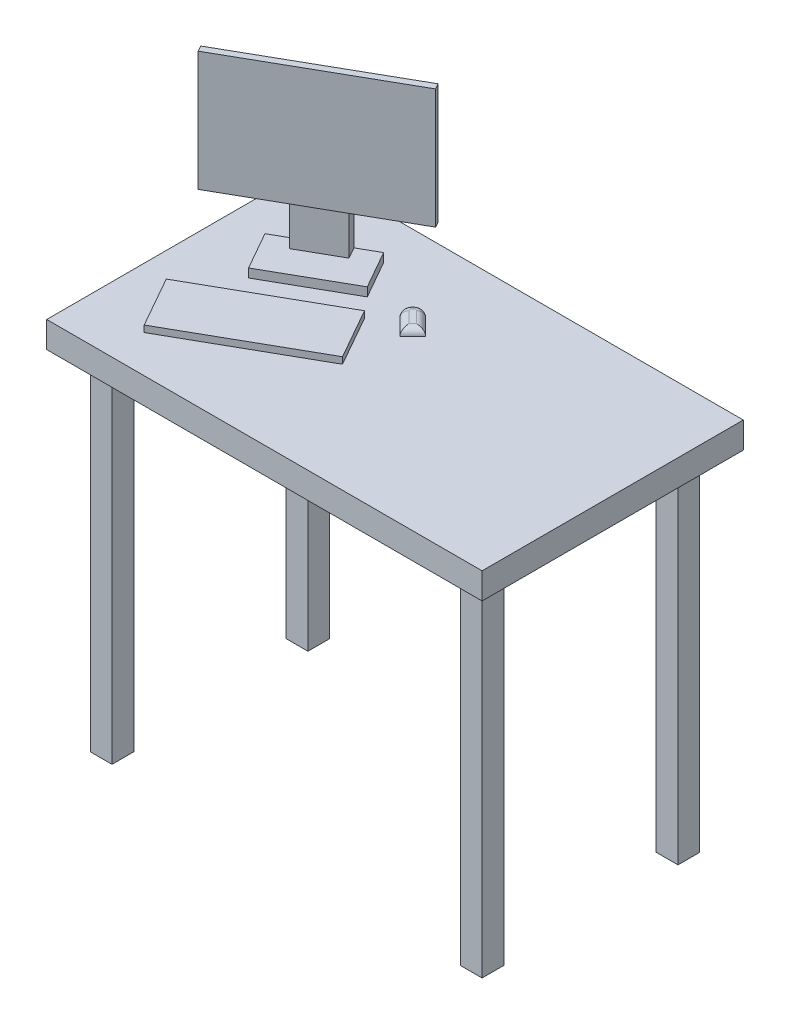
ISO-10303-21;
HEADER;
FILE_DESCRIPTION(('STEP AP214'),'2;1');
FILE_NAME('part.step','',(''),(''),'','','');
FILE_SCHEMA(('AUTOMOTIVE_DESIGN { 1 0 10303 214 1 1 1 1 }'));
ENDSEC;
DATA;
#1=APPLICATION_CONTEXT('core data for automotive mechanical design processes');
#2=APPLICATION_PROTOCOL_DEFINITION('international standard','automotive_design',2000,#1);
#3=PRODUCT_CONTEXT('',#1,'mechanical');
#4=PRODUCT('Part','Part','',(#3));
#5=PRODUCT_RELATED_PRODUCT_CATEGORY('part','',(#4));
#6=PRODUCT_DEFINITION_FORMATION('','',#4);
#7=PRODUCT_DEFINITION_CONTEXT('part definition',#1,'design');
#8=PRODUCT_DEFINITION('design','',#6,#7);
#9=PRODUCT_DEFINITION_SHAPE('','',#8);
#10=(LENGTH_UNIT() NAMED_UNIT(*) SI_UNIT(.MILLI.,.METRE.));
#11=(NAMED_UNIT(*) PLANE_ANGLE_UNIT() SI_UNIT($,.RADIAN.));
#12=(NAMED_UNIT(*) SI_UNIT($,.STERADIAN.) SOLID_ANGLE_UNIT());
#13=UNCERTAINTY_MEASURE_WITH_UNIT(LENGTH_MEASURE(1.E-05),#10,'distance_accuracy_value','');
#14=(GEOMETRIC_REPRESENTATION_CONTEXT(3) GLOBAL_UNCERTAINTY_ASSIGNED_CONTEXT((#13)) GLOBAL_UNIT_ASSIGNED_CONTEXT((#10,
#11,#12)) REPRESENTATION_CONTEXT('',''));
#15=CARTESIAN_POINT('',(0.,0.,0.));
#16=DIRECTION('',(0.,0.,1.));
#17=DIRECTION('',(1.,0.,0.));
#18=AXIS2_PLACEMENT_3D('',#15,#16,#17);
#19=CARTESIAN_POINT('',(0.,60.,0.));
#20=DIRECTION('',(0.,1.,0.));
#21=DIRECTION('',(0.,0.,1.));
#22=AXIS2_PLACEMENT_3D('',#19,#20,#21);
#23=PLANE('',#22);
#24=DIRECTION('',(0.,0.,1.));
#25=VECTOR('',#24,1.);
#26=CARTESIAN_POINT('',(-500.,60.,300.));
#27=LINE('',#26,#25);
#28=CARTESIAN_POINT('',(-500.,60.,-300.));
#29=VERTEX_POINT('',#28);
#30=CARTESIAN_POINT('',(-500.,60.,300.));
#31=VERTEX_POINT('',#30);
#32=EDGE_CURVE('E1023',#29,#31,#27,.T.);
#33=ORIENTED_EDGE('',*,*,#32,.T.);
#34=DIRECTION('',(1.,0.,0.));
#35=VECTOR('',#34,1.);
#36=CARTESIAN_POINT('',(500.,60.,300.));
#37=LINE('',#36,#35);
#38=CARTESIAN_POINT('',(500.,60.,300.));
#39=VERTEX_POINT('',#38);
#40=EDGE_CURVE('E1025',#31,#39,#37,.T.);
#41=ORIENTED_EDGE('',*,*,#40,.T.);
#42=DIRECTION('',(0.,0.,-1.));
#43=VECTOR('',#42,1.);
#44=CARTESIAN_POINT('',(500.,60.,300.));
#45=LINE('',#44,#43);
#46=CARTESIAN_POINT('',(500.,60.,-300.));
#47=VERTEX_POINT('',#46);
#48=EDGE_CURVE('E1028',#39,#47,#45,.T.);
#49=ORIENTED_EDGE('',*,*,#48,.T.);
#50=DIRECTION('',(-1.,0.,0.));
#51=VECTOR('',#50,1.);
#52=CARTESIAN_POINT('',(500.,60.,-300.));
#53=LINE('',#52,#51);
#54=EDGE_CURVE('E1030',#47,#29,#53,.T.);
#55=ORIENTED_EDGE('',*,*,#54,.T.);
#56=EDGE_LOOP('',(#33,#41,#49,#55));
#57=FACE_BOUND('',#56,.T.);
#58=DIRECTION('',(-0.493721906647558,0.,-0.869619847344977));
#59=VECTOR('',#58,1.);
#60=CARTESIAN_POINT('',(-176.703839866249,60.,-113.038015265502));
#61=LINE('',#60,#59);
#62=CARTESIAN_POINT('',(-176.703839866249,60.,-113.038015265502));
#63=VERTEX_POINT('',#62);
#64=CARTESIAN_POINT('',(-226.076030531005,60.,-200.));
#65=VERTEX_POINT('',#64);
#66=EDGE_CURVE('E1067',#63,#65,#61,.T.);
#67=ORIENTED_EDGE('',*,*,#66,.F.);
#68=DIRECTION('',(0.869619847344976,0.,-0.493721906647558));
#69=VECTOR('',#68,1.);
#70=CARTESIAN_POINT('',(-350.627809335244,60.,-14.293633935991));
#71=LINE('',#70,#69);
#72=CARTESIAN_POINT('',(-350.627809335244,60.,-14.293633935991));
#73=VERTEX_POINT('',#72);
#74=EDGE_CURVE('E1064',#73,#63,#71,.T.);
#75=ORIENTED_EDGE('',*,*,#74,.F.);
#76=DIRECTION('',(0.493721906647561,0.,0.869619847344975));
#77=VECTOR('',#76,1.);
#78=CARTESIAN_POINT('',(-350.627809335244,60.,-14.293633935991));
#79=LINE('',#78,#77);
#80=CARTESIAN_POINT('',(-400.,60.,-101.255618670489));
#81=VERTEX_POINT('',#80);
#82=EDGE_CURVE('E1073',#81,#73,#79,.T.);
#83=ORIENTED_EDGE('',*,*,#82,.F.);
#84=DIRECTION('',(-0.869619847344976,0.,0.493721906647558));
#85=VECTOR('',#84,1.);
#86=CARTESIAN_POINT('',(-400.,60.,-101.255618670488));
#87=LINE('',#86,#85);
#88=EDGE_CURVE('E1070',#65,#81,#87,.T.);
#89=ORIENTED_EDGE('',*,*,#88,.F.);
#90=EDGE_LOOP('',(#67,#75,#83,#89));
#91=FACE_BOUND('',#90,.T.);
#92=DIRECTION('',(0.87017204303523,0.,-0.492748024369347));
#93=VECTOR('',#92,1.);
#94=CARTESIAN_POINT('',(-361.990492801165,60.,214.095381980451));
#95=LINE('',#94,#93);
#96=CARTESIAN_POINT('',(-361.990492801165,60.,214.095381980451));
#97=VERTEX_POINT('',#96);
#98=CARTESIAN_POINT('',(-71.1847467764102,60.,49.422248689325));
#99=VERTEX_POINT('',#98);
#100=EDGE_CURVE('E351',#97,#99,#95,.T.);
#101=ORIENTED_EDGE('',*,*,#100,.F.);
#102=DIRECTION('',(0.492748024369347,0.,0.870172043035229));
#103=VECTOR('',#102,1.);
#104=CARTESIAN_POINT('',(-428.123184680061,60.,97.3078622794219));
#105=LINE('',#104,#103);
#106=CARTESIAN_POINT('',(-428.123184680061,60.,97.3078622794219));
#107=VERTEX_POINT('',#106);
#108=EDGE_CURVE('E337',#107,#97,#105,.T.);
#109=ORIENTED_EDGE('',*,*,#108,.F.);
#110=DIRECTION('',(-0.870172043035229,0.,0.492748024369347));
#111=VECTOR('',#110,1.);
#112=CARTESIAN_POINT('',(-428.123184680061,60.,97.3078622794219));
#113=LINE('',#112,#111);
#114=CARTESIAN_POINT('',(-137.317438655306,60.,-67.3652710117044));
#115=VERTEX_POINT('',#114);
#116=EDGE_CURVE('E342',#115,#107,#113,.T.);
#117=ORIENTED_EDGE('',*,*,#116,.F.);
#118=DIRECTION('',(-0.492748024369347,0.,-0.870172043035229));
#119=VECTOR('',#118,1.);
#120=CARTESIAN_POINT('',(-137.317438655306,60.,-67.3652710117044));
#121=LINE('',#120,#119);
#122=EDGE_CURVE('E353',#99,#115,#121,.T.);
#123=ORIENTED_EDGE('',*,*,#122,.F.);
#124=EDGE_LOOP('',(#101,#109,#117,#123));
#125=FACE_BOUND('',#124,.T.);
#126=DIRECTION('',(0.707106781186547,0.,-0.707106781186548));
#127=VECTOR('',#126,1.);
#128=CARTESIAN_POINT('',(-60.5107468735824,60.,-71.5720058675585));
#129=LINE('',#128,#127);
#130=CARTESIAN_POINT('',(-60.5107468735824,60.,-71.5720058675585));
#131=VERTEX_POINT('',#130);
#132=CARTESIAN_POINT('',(-30.7579985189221,60.,-101.324754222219));
#133=VERTEX_POINT('',#132);
#134=EDGE_CURVE('E316',#131,#133,#129,.T.);
#135=ORIENTED_EDGE('',*,*,#134,.F.);
#136=DIRECTION('',(0.707106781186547,0.,0.707106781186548));
#137=VECTOR('',#136,1.);
#138=CARTESIAN_POINT('',(-111.152332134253,60.,-122.213591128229));
#139=LINE('',#138,#137);
#140=CARTESIAN_POINT('',(-97.0101965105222,60.,-108.071455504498));
#141=VERTEX_POINT('',#140);
#142=EDGE_CURVE('E323',#141,#131,#139,.T.);
#143=ORIENTED_EDGE('',*,*,#142,.F.);
#144=CARTESIAN_POINT('',(-82.8680608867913,60.,-122.213591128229));
#145=DIRECTION('',(0.,1.,0.));
#146=DIRECTION('',(0.,0.,1.));
#147=AXIS2_PLACEMENT_3D('',#144,#145,#146);
#148=CIRCLE('',#147,20.);
#149=CARTESIAN_POINT('',(-97.0101965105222,60.,-136.35572675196));
#150=VERTEX_POINT('',#149);
#151=EDGE_CURVE('E433',#141,#150,#148,.F.);
#152=ORIENTED_EDGE('',*,*,#151,.T.);
#153=DIRECTION('',(-0.707106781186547,0.,0.707106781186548));
#154=VECTOR('',#153,1.);
#155=CARTESIAN_POINT('',(-111.152332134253,60.,-122.213591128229));
#156=LINE('',#155,#154);
#157=CARTESIAN_POINT('',(-95.5417194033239,60.,-137.824203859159));
#158=VERTEX_POINT('',#157);
#159=EDGE_CURVE('E332',#158,#150,#156,.T.);
#160=ORIENTED_EDGE('',*,*,#159,.F.);
#161=CARTESIAN_POINT('',(-81.399583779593,60.,-123.682068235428));
#162=DIRECTION('',(0.,1.,0.));
#163=DIRECTION('',(0.,0.,1.));
#164=AXIS2_PLACEMENT_3D('',#161,#162,#163);
#165=CIRCLE('',#164,20.);
#166=CARTESIAN_POINT('',(-67.257448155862,60.,-137.824203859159));
#167=VERTEX_POINT('',#166);
#168=EDGE_CURVE('E431',#158,#167,#165,.F.);
#169=ORIENTED_EDGE('',*,*,#168,.T.);
#170=DIRECTION('',(-0.707106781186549,0.,-0.707106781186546));
#171=VECTOR('',#170,1.);
#172=CARTESIAN_POINT('',(-81.399583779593,60.,-151.96633948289));
#173=LINE('',#172,#171);
#174=EDGE_CURVE('E330',#133,#167,#173,.T.);
#175=ORIENTED_EDGE('',*,*,#174,.F.);
#176=EDGE_LOOP('',(#135,#143,#152,#160,#169,#175));
#177=FACE_BOUND('',#176,.T.);
#178=ADVANCED_FACE('F37',(#57,#91,#125,#177),#23,.T.);
#179=CARTESIAN_POINT('',(-341.707350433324,280.,-99.8531185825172));
#180=DIRECTION('',(-0.493721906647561,0.,-0.869619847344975));
#181=DIRECTION('',(-0.869619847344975,0.,0.493721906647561));
#182=AXIS2_PLACEMENT_3D('',#179,#180,#181);
#183=PLANE('',#182);
#184=DIRECTION('',(0.869619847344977,0.,-0.493721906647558));
#185=VECTOR('',#184,1.);
#186=CARTESIAN_POINT('',(-472.150327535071,180.,-25.7948325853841));
#187=LINE('',#186,#185);
#188=CARTESIAN_POINT('',(-341.707350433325,180.,-99.8531185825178));
#189=VERTEX_POINT('',#188);
#190=CARTESIAN_POINT('',(-254.745365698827,180.,-149.225309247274));
#191=VERTEX_POINT('',#190);
#192=EDGE_CURVE('E385',#189,#191,#187,.T.);
#193=ORIENTED_EDGE('',*,*,#192,.F.);
#194=DIRECTION('',(0.,-1.,0.));
#195=VECTOR('',#194,1.);
#196=CARTESIAN_POINT('',(-341.707350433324,280.,-99.8531185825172));
#197=LINE('',#196,#195);
#198=CARTESIAN_POINT('',(-341.707350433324,80.,-99.8531185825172));
#199=VERTEX_POINT('',#198);
#200=EDGE_CURVE('E1245',#189,#199,#197,.T.);
#201=ORIENTED_EDGE('',*,*,#200,.T.);
#202=DIRECTION('',(0.869619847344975,0.,-0.493721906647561));
#203=VECTOR('',#202,1.);
#204=CARTESIAN_POINT('',(-341.707350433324,80.,-99.8531185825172));
#205=LINE('',#204,#203);
#206=CARTESIAN_POINT('',(-254.745365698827,80.,-149.225309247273));
#207=VERTEX_POINT('',#206);
#208=EDGE_CURVE('E412',#199,#207,#205,.T.);
#209=ORIENTED_EDGE('',*,*,#208,.T.);
#210=DIRECTION('',(0.,-1.,0.));
#211=VECTOR('',#210,1.);
#212=CARTESIAN_POINT('',(-254.745365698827,280.,-149.225309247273));
#213=LINE('',#212,#211);
#214=EDGE_CURVE('E428',#191,#207,#213,.T.);
#215=ORIENTED_EDGE('',*,*,#214,.F.);
#216=EDGE_LOOP('',(#193,#201,#209,#215));
#217=FACE_BOUND('',#216,.T.);
#218=ADVANCED_FACE('F476',(#217),#183,.F.);
#219=CARTESIAN_POINT('',(0.,0.,0.));
#220=DIRECTION('',(0.,1.,0.));
#221=DIRECTION('',(0.,0.,1.));
#222=AXIS2_PLACEMENT_3D('',#219,#220,#221);
#223=PLANE('',#222);
#224=DIRECTION('',(1.,0.,0.));
#225=VECTOR('',#224,1.);
#226=CARTESIAN_POINT('',(-450.,0.,-200.));
#227=LINE('',#226,#225);
#228=CARTESIAN_POINT('',(-450.,0.,-200.));
#229=VERTEX_POINT('',#228);
#230=CARTESIAN_POINT('',(-400.,0.,-200.));
#231=VERTEX_POINT('',#230);
#232=EDGE_CURVE('E1102',#229,#231,#227,.T.);
#233=ORIENTED_EDGE('',*,*,#232,.T.);
#234=DIRECTION('',(0.,0.,-1.));
#235=VECTOR('',#234,1.);
#236=CARTESIAN_POINT('',(-400.,0.,-250.));
#237=LINE('',#236,#235);
#238=CARTESIAN_POINT('',(-400.,0.,-250.));
#239=VERTEX_POINT('',#238);
#240=EDGE_CURVE('E1085',#231,#239,#237,.T.);
#241=ORIENTED_EDGE('',*,*,#240,.T.);
#242=DIRECTION('',(-1.,0.,0.));
#243=VECTOR('',#242,1.);
#244=CARTESIAN_POINT('',(-450.,0.,-250.));
#245=LINE('',#244,#243);
#246=CARTESIAN_POINT('',(-450.,0.,-250.));
#247=VERTEX_POINT('',#246);
#248=EDGE_CURVE('E1090',#239,#247,#245,.T.);
#249=ORIENTED_EDGE('',*,*,#248,.T.);
#250=DIRECTION('',(0.,0.,1.));
#251=VECTOR('',#250,1.);
#252=CARTESIAN_POINT('',(-450.,0.,-250.));
#253=LINE('',#252,#251);
#254=EDGE_CURVE('E1105',#247,#229,#253,.T.);
#255=ORIENTED_EDGE('',*,*,#254,.T.);
#256=EDGE_LOOP('',(#233,#241,#249,#255));
#257=FACE_BOUND('',#256,.T.);
#258=DIRECTION('',(0.,0.,1.));
#259=VECTOR('',#258,1.);
#260=CARTESIAN_POINT('',(-400.,0.,250.));
#261=LINE('',#260,#259);
#262=CARTESIAN_POINT('',(-400.,0.,200.));
#263=VERTEX_POINT('',#262);
#264=CARTESIAN_POINT('',(-400.,0.,250.));
#265=VERTEX_POINT('',#264);
#266=EDGE_CURVE('E989',#263,#265,#261,.T.);
#267=ORIENTED_EDGE('',*,*,#266,.F.);
#268=DIRECTION('',(1.,0.,0.));
#269=VECTOR('',#268,1.);
#270=CARTESIAN_POINT('',(-450.,0.,200.));
#271=LINE('',#270,#269);
#272=CARTESIAN_POINT('',(-450.,0.,200.));
#273=VERTEX_POINT('',#272);
#274=EDGE_CURVE('E1011',#273,#263,#271,.T.);
#275=ORIENTED_EDGE('',*,*,#274,.F.);
#276=DIRECTION('',(0.,0.,-1.));
#277=VECTOR('',#276,1.);
#278=CARTESIAN_POINT('',(-450.,0.,250.));
#279=LINE('',#278,#277);
#280=CARTESIAN_POINT('',(-450.,0.,250.));
#281=VERTEX_POINT('',#280);
#282=EDGE_CURVE('E1001',#281,#273,#279,.T.);
#283=ORIENTED_EDGE('',*,*,#282,.F.);
#284=DIRECTION('',(-1.,0.,0.));
#285=VECTOR('',#284,1.);
#286=CARTESIAN_POINT('',(-450.,0.,250.));
#287=LINE('',#286,#285);
#288=EDGE_CURVE('E997',#265,#281,#287,.T.);
#289=ORIENTED_EDGE('',*,*,#288,.F.);
#290=EDGE_LOOP('',(#267,#275,#283,#289));
#291=FACE_BOUND('',#290,.T.);
#292=DIRECTION('',(0.,0.,1.));
#293=VECTOR('',#292,1.);
#294=CARTESIAN_POINT('',(-500.,0.,300.));
#295=LINE('',#294,#293);
#296=CARTESIAN_POINT('',(-500.,0.,-300.));
#297=VERTEX_POINT('',#296);
#298=CARTESIAN_POINT('',(-500.,0.,300.));
#299=VERTEX_POINT('',#298);
#300=EDGE_CURVE('E1022',#297,#299,#295,.T.);
#301=ORIENTED_EDGE('',*,*,#300,.F.);
#302=DIRECTION('',(-1.,0.,0.));
#303=VECTOR('',#302,1.);
#304=CARTESIAN_POINT('',(500.,0.,-300.));
#305=LINE('',#304,#303);
#306=CARTESIAN_POINT('',(500.,0.,-300.));
#307=VERTEX_POINT('',#306);
#308=EDGE_CURVE('E1026',#307,#297,#305,.T.);
#309=ORIENTED_EDGE('',*,*,#308,.F.);
#310=DIRECTION('',(0.,0.,-1.));
#311=VECTOR('',#310,1.);
#312=CARTESIAN_POINT('',(500.,0.,300.));
#313=LINE('',#312,#311);
#314=CARTESIAN_POINT('',(500.,0.,300.));
#315=VERTEX_POINT('',#314);
#316=EDGE_CURVE('E1037',#315,#307,#313,.T.);
#317=ORIENTED_EDGE('',*,*,#316,.F.);
#318=DIRECTION('',(1.,0.,0.));
#319=VECTOR('',#318,1.);
#320=CARTESIAN_POINT('',(500.,0.,300.));
#321=LINE('',#320,#319);
#322=EDGE_CURVE('E1035',#299,#315,#321,.T.);
#323=ORIENTED_EDGE('',*,*,#322,.F.);
#324=EDGE_LOOP('',(#301,#309,#317,#323));
#325=FACE_BOUND('',#324,.T.);
#326=DIRECTION('',(-1.,0.,0.));
#327=VECTOR('',#326,1.);
#328=CARTESIAN_POINT('',(450.,0.,200.));
#329=LINE('',#328,#327);
#330=CARTESIAN_POINT('',(450.,0.,200.));
#331=VERTEX_POINT('',#330);
#332=CARTESIAN_POINT('',(400.,0.,200.));
#333=VERTEX_POINT('',#332);
#334=EDGE_CURVE('E1168',#331,#333,#329,.T.);
#335=ORIENTED_EDGE('',*,*,#334,.T.);
#336=DIRECTION('',(0.,0.,1.));
#337=VECTOR('',#336,1.);
#338=CARTESIAN_POINT('',(400.,0.,250.));
#339=LINE('',#338,#337);
#340=CARTESIAN_POINT('',(400.,0.,250.));
#341=VERTEX_POINT('',#340);
#342=EDGE_CURVE('E1151',#333,#341,#339,.T.);
#343=ORIENTED_EDGE('',*,*,#342,.T.);
#344=DIRECTION('',(1.,0.,0.));
#345=VECTOR('',#344,1.);
#346=CARTESIAN_POINT('',(450.,0.,250.));
#347=LINE('',#346,#345);
#348=CARTESIAN_POINT('',(450.,0.,250.));
#349=VERTEX_POINT('',#348);
#350=EDGE_CURVE('E1156',#341,#349,#347,.T.);
#351=ORIENTED_EDGE('',*,*,#350,.T.);
#352=DIRECTION('',(0.,0.,-1.));
#353=VECTOR('',#352,1.);
#354=CARTESIAN_POINT('',(450.,0.,250.));
#355=LINE('',#354,#353);
#356=EDGE_CURVE('E1171',#349,#331,#355,.T.);
#357=ORIENTED_EDGE('',*,*,#356,.T.);
#358=EDGE_LOOP('',(#335,#343,#351,#357));
#359=FACE_BOUND('',#358,.T.);
#360=DIRECTION('',(0.,0.,-1.));
#361=VECTOR('',#360,1.);
#362=CARTESIAN_POINT('',(400.,0.,-250.));
#363=LINE('',#362,#361);
#364=CARTESIAN_POINT('',(400.,0.,-200.));
#365=VERTEX_POINT('',#364);
#366=CARTESIAN_POINT('',(400.,0.,-250.));
#367=VERTEX_POINT('',#366);
#368=EDGE_CURVE('E1118',#365,#367,#363,.T.);
#369=ORIENTED_EDGE('',*,*,#368,.F.);
#370=DIRECTION('',(-1.,0.,0.));
#371=VECTOR('',#370,1.);
#372=CARTESIAN_POINT('',(450.,0.,-200.));
#373=LINE('',#372,#371);
#374=CARTESIAN_POINT('',(450.,0.,-200.));
#375=VERTEX_POINT('',#374);
#376=EDGE_CURVE('E1123',#375,#365,#373,.T.);
#377=ORIENTED_EDGE('',*,*,#376,.F.);
#378=DIRECTION('',(0.,0.,1.));
#379=VECTOR('',#378,1.);
#380=CARTESIAN_POINT('',(450.,0.,-250.));
#381=LINE('',#380,#379);
#382=CARTESIAN_POINT('',(450.,0.,-250.));
#383=VERTEX_POINT('',#382);
#384=EDGE_CURVE('E1135',#383,#375,#381,.T.);
#385=ORIENTED_EDGE('',*,*,#384,.F.);
#386=DIRECTION('',(1.,0.,0.));
#387=VECTOR('',#386,1.);
#388=CARTESIAN_POINT('',(450.,0.,-250.));
#389=LINE('',#388,#387);
#390=EDGE_CURVE('E1132',#367,#383,#389,.T.);
#391=ORIENTED_EDGE('',*,*,#390,.F.);
#392=EDGE_LOOP('',(#369,#377,#385,#391));
#393=FACE_BOUND('',#392,.T.);
#394=ADVANCED_FACE('F482',(#257,#291,#325,#359,#393),#223,.F.);
#395=CARTESIAN_POINT('',(-500.,60.,300.));
#396=DIRECTION('',(1.,0.,0.));
#397=DIRECTION('',(0.,0.,-1.));
#398=AXIS2_PLACEMENT_3D('',#395,#396,#397);
#399=PLANE('',#398);
#400=ORIENTED_EDGE('',*,*,#300,.T.);
#401=DIRECTION('',(0.,-1.,0.));
#402=VECTOR('',#401,1.);
#403=CARTESIAN_POINT('',(-500.,60.,300.));
#404=LINE('',#403,#402);
#405=EDGE_CURVE('E434',#31,#299,#404,.T.);
#406=ORIENTED_EDGE('',*,*,#405,.F.);
#407=ORIENTED_EDGE('',*,*,#32,.F.);
#408=DIRECTION('',(0.,-1.,0.));
#409=VECTOR('',#408,1.);
#410=CARTESIAN_POINT('',(-500.,60.,-300.));
#411=LINE('',#410,#409);
#412=EDGE_CURVE('E1032',#29,#297,#411,.T.);
#413=ORIENTED_EDGE('',*,*,#412,.T.);
#414=EDGE_LOOP('',(#400,#406,#407,#413));
#415=FACE_BOUND('',#414,.T.);
#416=ADVANCED_FACE('F493',(#415),#399,.F.);
#417=CARTESIAN_POINT('',(500.,60.,300.));
#418=DIRECTION('',(0.,0.,-1.));
#419=DIRECTION('',(-1.,0.,0.));
#420=AXIS2_PLACEMENT_3D('',#417,#418,#419);
#421=PLANE('',#420);
#422=ORIENTED_EDGE('',*,*,#322,.T.);
#423=DIRECTION('',(0.,-1.,0.));
#424=VECTOR('',#423,1.);
#425=CARTESIAN_POINT('',(500.,60.,300.));
#426=LINE('',#425,#424);
#427=EDGE_CURVE('E1045',#39,#315,#426,.T.);
#428=ORIENTED_EDGE('',*,*,#427,.F.);
#429=ORIENTED_EDGE('',*,*,#40,.F.);
#430=ORIENTED_EDGE('',*,*,#405,.T.);
#431=EDGE_LOOP('',(#422,#428,#429,#430));
#432=FACE_BOUND('',#431,.T.);
#433=ADVANCED_FACE('F502',(#432),#421,.F.);
#434=CARTESIAN_POINT('',(500.,60.,300.));
#435=DIRECTION('',(-1.,0.,0.));
#436=DIRECTION('',(0.,0.,1.));
#437=AXIS2_PLACEMENT_3D('',#434,#435,#436);
#438=PLANE('',#437);
#439=ORIENTED_EDGE('',*,*,#316,.T.);
#440=DIRECTION('',(0.,-1.,0.));
#441=VECTOR('',#440,1.);
#442=CARTESIAN_POINT('',(500.,60.,-300.));
#443=LINE('',#442,#441);
#444=EDGE_CURVE('E1042',#47,#307,#443,.T.);
#445=ORIENTED_EDGE('',*,*,#444,.F.);
#446=ORIENTED_EDGE('',*,*,#48,.F.);
#447=ORIENTED_EDGE('',*,*,#427,.T.);
#448=EDGE_LOOP('',(#439,#445,#446,#447));
#449=FACE_BOUND('',#448,.T.);
#450=ADVANCED_FACE('F498',(#449),#438,.F.);
#451=CARTESIAN_POINT('',(500.,60.,-300.));
#452=DIRECTION('',(0.,0.,1.));
#453=DIRECTION('',(1.,0.,0.));
#454=AXIS2_PLACEMENT_3D('',#451,#452,#453);
#455=PLANE('',#454);
#456=ORIENTED_EDGE('',*,*,#308,.T.);
#457=ORIENTED_EDGE('',*,*,#412,.F.);
#458=ORIENTED_EDGE('',*,*,#54,.F.);
#459=ORIENTED_EDGE('',*,*,#444,.T.);
#460=EDGE_LOOP('',(#456,#457,#458,#459));
#461=FACE_BOUND('',#460,.T.);
#462=ADVANCED_FACE('F495',(#461),#455,.F.);
#463=CARTESIAN_POINT('',(-400.,-800.,250.));
#464=DIRECTION('',(-1.,0.,0.));
#465=DIRECTION('',(0.,0.,1.));
#466=AXIS2_PLACEMENT_3D('',#463,#464,#465);
#467=PLANE('',#466);
#468=ORIENTED_EDGE('',*,*,#266,.T.);
#469=DIRECTION('',(0.,1.,0.));
#470=VECTOR('',#469,1.);
#471=CARTESIAN_POINT('',(-400.,-800.,250.));
#472=LINE('',#471,#470);
#473=CARTESIAN_POINT('',(-400.,-800.,250.));
#474=VERTEX_POINT('',#473);
#475=EDGE_CURVE('E992',#474,#265,#472,.T.);
#476=ORIENTED_EDGE('',*,*,#475,.F.);
#477=DIRECTION('',(0.,0.,1.));
#478=VECTOR('',#477,1.);
#479=CARTESIAN_POINT('',(-400.,-800.,250.));
#480=LINE('',#479,#478);
#481=CARTESIAN_POINT('',(-400.,-800.,200.));
#482=VERTEX_POINT('',#481);
#483=EDGE_CURVE('E1013',#482,#474,#480,.T.);
#484=ORIENTED_EDGE('',*,*,#483,.F.);
#485=DIRECTION('',(0.,1.,0.));
#486=VECTOR('',#485,1.);
#487=CARTESIAN_POINT('',(-400.,-800.,200.));
#488=LINE('',#487,#486);
#489=EDGE_CURVE('E994',#482,#263,#488,.T.);
#490=ORIENTED_EDGE('',*,*,#489,.T.);
#491=EDGE_LOOP('',(#468,#476,#484,#490));
#492=FACE_BOUND('',#491,.T.);
#493=ADVANCED_FACE('F489',(#492),#467,.F.);
#494=CARTESIAN_POINT('',(-450.,-800.,250.));
#495=DIRECTION('',(0.,0.,-1.));
#496=DIRECTION('',(-1.,0.,0.));
#497=AXIS2_PLACEMENT_3D('',#494,#495,#496);
#498=PLANE('',#497);
#499=ORIENTED_EDGE('',*,*,#288,.T.);
#500=DIRECTION('',(0.,1.,0.));
#501=VECTOR('',#500,1.);
#502=CARTESIAN_POINT('',(-450.,-800.,250.));
#503=LINE('',#502,#501);
#504=CARTESIAN_POINT('',(-450.,-800.,250.));
#505=VERTEX_POINT('',#504);
#506=EDGE_CURVE('E1018',#505,#281,#503,.T.);
#507=ORIENTED_EDGE('',*,*,#506,.F.);
#508=DIRECTION('',(-1.,0.,0.));
#509=VECTOR('',#508,1.);
#510=CARTESIAN_POINT('',(-450.,-800.,250.));
#511=LINE('',#510,#509);
#512=EDGE_CURVE('E1183',#474,#505,#511,.T.);
#513=ORIENTED_EDGE('',*,*,#512,.F.);
#514=ORIENTED_EDGE('',*,*,#475,.T.);
#515=EDGE_LOOP('',(#499,#507,#513,#514));
#516=FACE_BOUND('',#515,.T.);
#517=ADVANCED_FACE('F941',(#516),#498,.F.);
#518=CARTESIAN_POINT('',(-450.,-800.,250.));
#519=DIRECTION('',(1.,0.,0.));
#520=DIRECTION('',(0.,0.,-1.));
#521=AXIS2_PLACEMENT_3D('',#518,#519,#520);
#522=PLANE('',#521);
#523=ORIENTED_EDGE('',*,*,#282,.T.);
#524=DIRECTION('',(0.,1.,0.));
#525=VECTOR('',#524,1.);
#526=CARTESIAN_POINT('',(-450.,-800.,200.));
#527=LINE('',#526,#525);
#528=CARTESIAN_POINT('',(-450.,-800.,200.));
#529=VERTEX_POINT('',#528);
#530=EDGE_CURVE('E1015',#529,#273,#527,.T.);
#531=ORIENTED_EDGE('',*,*,#530,.F.);
#532=DIRECTION('',(0.,0.,-1.));
#533=VECTOR('',#532,1.);
#534=CARTESIAN_POINT('',(-450.,-800.,250.));
#535=LINE('',#534,#533);
#536=EDGE_CURVE('E1184',#505,#529,#535,.T.);
#537=ORIENTED_EDGE('',*,*,#536,.F.);
#538=ORIENTED_EDGE('',*,*,#506,.T.);
#539=EDGE_LOOP('',(#523,#531,#537,#538));
#540=FACE_BOUND('',#539,.T.);
#541=ADVANCED_FACE('F931',(#540),#522,.F.);
#542=CARTESIAN_POINT('',(-450.,-800.,200.));
#543=DIRECTION('',(0.,0.,1.));
#544=DIRECTION('',(1.,0.,0.));
#545=AXIS2_PLACEMENT_3D('',#542,#543,#544);
#546=PLANE('',#545);
#547=ORIENTED_EDGE('',*,*,#274,.T.);
#548=ORIENTED_EDGE('',*,*,#489,.F.);
#549=DIRECTION('',(1.,0.,0.));
#550=VECTOR('',#549,1.);
#551=CARTESIAN_POINT('',(-450.,-800.,200.));
#552=LINE('',#551,#550);
#553=EDGE_CURVE('E1006',#529,#482,#552,.T.);
#554=ORIENTED_EDGE('',*,*,#553,.F.);
#555=ORIENTED_EDGE('',*,*,#530,.T.);
#556=EDGE_LOOP('',(#547,#548,#554,#555));
#557=FACE_BOUND('',#556,.T.);
#558=ADVANCED_FACE('F921',(#557),#546,.F.);
#559=CARTESIAN_POINT('',(0.,-800.,0.));
#560=DIRECTION('',(0.,-1.,0.));
#561=DIRECTION('',(0.,0.,-1.));
#562=AXIS2_PLACEMENT_3D('',#559,#560,#561);
#563=PLANE('',#562);
#564=ORIENTED_EDGE('',*,*,#483,.T.);
#565=ORIENTED_EDGE('',*,*,#512,.T.);
#566=ORIENTED_EDGE('',*,*,#536,.T.);
#567=ORIENTED_EDGE('',*,*,#553,.T.);
#568=EDGE_LOOP('',(#564,#565,#566,#567));
#569=FACE_BOUND('',#568,.T.);
#570=ADVANCED_FACE('F911',(#569),#563,.T.);
#571=CARTESIAN_POINT('',(400.,-800.,250.));
#572=DIRECTION('',(-1.,0.,0.));
#573=DIRECTION('',(0.,0.,1.));
#574=AXIS2_PLACEMENT_3D('',#571,#572,#573);
#575=PLANE('',#574);
#576=ORIENTED_EDGE('',*,*,#342,.F.);
#577=DIRECTION('',(0.,1.,0.));
#578=VECTOR('',#577,1.);
#579=CARTESIAN_POINT('',(400.,-800.,200.));
#580=LINE('',#579,#578);
#581=CARTESIAN_POINT('',(400.,-800.,200.));
#582=VERTEX_POINT('',#581);
#583=EDGE_CURVE('E998',#582,#333,#580,.T.);
#584=ORIENTED_EDGE('',*,*,#583,.F.);
#585=DIRECTION('',(0.,0.,1.));
#586=VECTOR('',#585,1.);
#587=CARTESIAN_POINT('',(400.,-800.,250.));
#588=LINE('',#587,#586);
#589=CARTESIAN_POINT('',(400.,-800.,250.));
#590=VERTEX_POINT('',#589);
#591=EDGE_CURVE('E1152',#582,#590,#588,.T.);
#592=ORIENTED_EDGE('',*,*,#591,.T.);
#593=DIRECTION('',(0.,1.,0.));
#594=VECTOR('',#593,1.);
#595=CARTESIAN_POINT('',(400.,-800.,250.));
#596=LINE('',#595,#594);
#597=EDGE_CURVE('E1165',#590,#341,#596,.T.);
#598=ORIENTED_EDGE('',*,*,#597,.T.);
#599=EDGE_LOOP('',(#576,#584,#592,#598));
#600=FACE_BOUND('',#599,.T.);
#601=ADVANCED_FACE('F901',(#600),#575,.T.);
#602=CARTESIAN_POINT('',(450.,-800.,200.));
#603=DIRECTION('',(0.,0.,-1.));
#604=DIRECTION('',(-1.,0.,0.));
#605=AXIS2_PLACEMENT_3D('',#602,#603,#604);
#606=PLANE('',#605);
#607=ORIENTED_EDGE('',*,*,#334,.F.);
#608=DIRECTION('',(0.,1.,0.));
#609=VECTOR('',#608,1.);
#610=CARTESIAN_POINT('',(450.,-800.,200.));
#611=LINE('',#610,#609);
#612=CARTESIAN_POINT('',(450.,-800.,200.));
#613=VERTEX_POINT('',#612);
#614=EDGE_CURVE('E1003',#613,#331,#611,.T.);
#615=ORIENTED_EDGE('',*,*,#614,.F.);
#616=DIRECTION('',(-1.,0.,0.));
#617=VECTOR('',#616,1.);
#618=CARTESIAN_POINT('',(450.,-800.,200.));
#619=LINE('',#618,#617);
#620=EDGE_CURVE('E1155',#613,#582,#619,.T.);
#621=ORIENTED_EDGE('',*,*,#620,.T.);
#622=ORIENTED_EDGE('',*,*,#583,.T.);
#623=EDGE_LOOP('',(#607,#615,#621,#622));
#624=FACE_BOUND('',#623,.T.);
#625=ADVANCED_FACE('F891',(#624),#606,.T.);
#626=CARTESIAN_POINT('',(450.,-800.,250.));
#627=DIRECTION('',(1.,0.,0.));
#628=DIRECTION('',(0.,0.,-1.));
#629=AXIS2_PLACEMENT_3D('',#626,#627,#628);
#630=PLANE('',#629);
#631=ORIENTED_EDGE('',*,*,#356,.F.);
#632=DIRECTION('',(0.,1.,0.));
#633=VECTOR('',#632,1.);
#634=CARTESIAN_POINT('',(450.,-800.,250.));
#635=LINE('',#634,#633);
#636=CARTESIAN_POINT('',(450.,-800.,250.));
#637=VERTEX_POINT('',#636);
#638=EDGE_CURVE('E1177',#637,#349,#635,.T.);
#639=ORIENTED_EDGE('',*,*,#638,.F.);
#640=DIRECTION('',(0.,0.,-1.));
#641=VECTOR('',#640,1.);
#642=CARTESIAN_POINT('',(450.,-800.,250.));
#643=LINE('',#642,#641);
#644=EDGE_CURVE('E1159',#637,#613,#643,.T.);
#645=ORIENTED_EDGE('',*,*,#644,.T.);
#646=ORIENTED_EDGE('',*,*,#614,.T.);
#647=EDGE_LOOP('',(#631,#639,#645,#646));
#648=FACE_BOUND('',#647,.T.);
#649=ADVANCED_FACE('F879',(#648),#630,.T.);
#650=CARTESIAN_POINT('',(450.,-800.,250.));
#651=DIRECTION('',(0.,0.,1.));
#652=DIRECTION('',(1.,0.,0.));
#653=AXIS2_PLACEMENT_3D('',#650,#651,#652);
#654=PLANE('',#653);
#655=ORIENTED_EDGE('',*,*,#350,.F.);
#656=ORIENTED_EDGE('',*,*,#597,.F.);
#657=DIRECTION('',(1.,0.,0.));
#658=VECTOR('',#657,1.);
#659=CARTESIAN_POINT('',(450.,-800.,250.));
#660=LINE('',#659,#658);
#661=EDGE_CURVE('E1162',#590,#637,#660,.T.);
#662=ORIENTED_EDGE('',*,*,#661,.T.);
#663=ORIENTED_EDGE('',*,*,#638,.T.);
#664=EDGE_LOOP('',(#655,#656,#662,#663));
#665=FACE_BOUND('',#664,.T.);
#666=ADVANCED_FACE('F867',(#665),#654,.T.);
#667=CARTESIAN_POINT('',(0.,-800.,0.));
#668=DIRECTION('',(0.,-1.,0.));
#669=DIRECTION('',(0.,0.,-1.));
#670=AXIS2_PLACEMENT_3D('',#667,#668,#669);
#671=PLANE('',#670);
#672=ORIENTED_EDGE('',*,*,#591,.F.);
#673=ORIENTED_EDGE('',*,*,#620,.F.);
#674=ORIENTED_EDGE('',*,*,#644,.F.);
#675=ORIENTED_EDGE('',*,*,#661,.F.);
#676=EDGE_LOOP('',(#672,#673,#674,#675));
#677=FACE_BOUND('',#676,.T.);
#678=ADVANCED_FACE('F851',(#677),#671,.T.);
#679=CARTESIAN_POINT('',(400.,-800.,-250.));
#680=DIRECTION('',(1.,0.,0.));
#681=DIRECTION('',(0.,0.,-1.));
#682=AXIS2_PLACEMENT_3D('',#679,#680,#681);
#683=PLANE('',#682);
#684=ORIENTED_EDGE('',*,*,#368,.T.);
#685=DIRECTION('',(0.,1.,0.));
#686=VECTOR('',#685,1.);
#687=CARTESIAN_POINT('',(400.,-800.,-250.));
#688=LINE('',#687,#686);
#689=CARTESIAN_POINT('',(400.,-800.,-250.));
#690=VERTEX_POINT('',#689);
#691=EDGE_CURVE('E1148',#690,#367,#688,.T.);
#692=ORIENTED_EDGE('',*,*,#691,.F.);
#693=DIRECTION('',(0.,0.,-1.));
#694=VECTOR('',#693,1.);
#695=CARTESIAN_POINT('',(400.,-800.,-250.));
#696=LINE('',#695,#694);
#697=CARTESIAN_POINT('',(400.,-800.,-200.));
#698=VERTEX_POINT('',#697);
#699=EDGE_CURVE('E1119',#698,#690,#696,.T.);
#700=ORIENTED_EDGE('',*,*,#699,.F.);
#701=DIRECTION('',(0.,1.,0.));
#702=VECTOR('',#701,1.);
#703=CARTESIAN_POINT('',(400.,-800.,-200.));
#704=LINE('',#703,#702);
#705=EDGE_CURVE('E1129',#698,#365,#704,.T.);
#706=ORIENTED_EDGE('',*,*,#705,.T.);
#707=EDGE_LOOP('',(#684,#692,#700,#706));
#708=FACE_BOUND('',#707,.T.);
#709=ADVANCED_FACE('F841',(#708),#683,.F.);
#710=CARTESIAN_POINT('',(450.,-800.,-250.));
#711=DIRECTION('',(0.,0.,1.));
#712=DIRECTION('',(1.,0.,0.));
#713=AXIS2_PLACEMENT_3D('',#710,#711,#712);
#714=PLANE('',#713);
#715=ORIENTED_EDGE('',*,*,#390,.T.);
#716=DIRECTION('',(0.,1.,0.));
#717=VECTOR('',#716,1.);
#718=CARTESIAN_POINT('',(450.,-800.,-250.));
#719=LINE('',#718,#717);
#720=CARTESIAN_POINT('',(450.,-800.,-250.));
#721=VERTEX_POINT('',#720);
#722=EDGE_CURVE('E1145',#721,#383,#719,.T.);
#723=ORIENTED_EDGE('',*,*,#722,.F.);
#724=DIRECTION('',(1.,0.,0.));
#725=VECTOR('',#724,1.);
#726=CARTESIAN_POINT('',(450.,-800.,-250.));
#727=LINE('',#726,#725);
#728=EDGE_CURVE('E1122',#690,#721,#727,.T.);
#729=ORIENTED_EDGE('',*,*,#728,.F.);
#730=ORIENTED_EDGE('',*,*,#691,.T.);
#731=EDGE_LOOP('',(#715,#723,#729,#730));
#732=FACE_BOUND('',#731,.T.);
#733=ADVANCED_FACE('F831',(#732),#714,.F.);
#734=CARTESIAN_POINT('',(450.,-800.,-250.));
#735=DIRECTION('',(-1.,0.,0.));
#736=DIRECTION('',(0.,0.,1.));
#737=AXIS2_PLACEMENT_3D('',#734,#735,#736);
#738=PLANE('',#737);
#739=ORIENTED_EDGE('',*,*,#384,.T.);
#740=DIRECTION('',(0.,1.,0.));
#741=VECTOR('',#740,1.);
#742=CARTESIAN_POINT('',(450.,-800.,-200.));
#743=LINE('',#742,#741);
#744=CARTESIAN_POINT('',(450.,-800.,-200.));
#745=VERTEX_POINT('',#744);
#746=EDGE_CURVE('E1142',#745,#375,#743,.T.);
#747=ORIENTED_EDGE('',*,*,#746,.F.);
#748=DIRECTION('',(0.,0.,1.));
#749=VECTOR('',#748,1.);
#750=CARTESIAN_POINT('',(450.,-800.,-250.));
#751=LINE('',#750,#749);
#752=EDGE_CURVE('E1125',#721,#745,#751,.T.);
#753=ORIENTED_EDGE('',*,*,#752,.F.);
#754=ORIENTED_EDGE('',*,*,#722,.T.);
#755=EDGE_LOOP('',(#739,#747,#753,#754));
#756=FACE_BOUND('',#755,.T.);
#757=ADVANCED_FACE('F820',(#756),#738,.F.);
#758=CARTESIAN_POINT('',(450.,-800.,-200.));
#759=DIRECTION('',(0.,0.,-1.));
#760=DIRECTION('',(-1.,0.,0.));
#761=AXIS2_PLACEMENT_3D('',#758,#759,#760);
#762=PLANE('',#761);
#763=ORIENTED_EDGE('',*,*,#376,.T.);
#764=ORIENTED_EDGE('',*,*,#705,.F.);
#765=DIRECTION('',(-1.,0.,0.));
#766=VECTOR('',#765,1.);
#767=CARTESIAN_POINT('',(450.,-800.,-200.));
#768=LINE('',#767,#766);
#769=EDGE_CURVE('E1127',#745,#698,#768,.T.);
#770=ORIENTED_EDGE('',*,*,#769,.F.);
#771=ORIENTED_EDGE('',*,*,#746,.T.);
#772=EDGE_LOOP('',(#763,#764,#770,#771));
#773=FACE_BOUND('',#772,.T.);
#774=ADVANCED_FACE('F808',(#773),#762,.F.);
#775=CARTESIAN_POINT('',(0.,-800.,0.));
#776=DIRECTION('',(0.,-1.,0.));
#777=DIRECTION('',(0.,0.,1.));
#778=AXIS2_PLACEMENT_3D('',#775,#776,#777);
#779=PLANE('',#778);
#780=ORIENTED_EDGE('',*,*,#699,.T.);
#781=ORIENTED_EDGE('',*,*,#728,.T.);
#782=ORIENTED_EDGE('',*,*,#752,.T.);
#783=ORIENTED_EDGE('',*,*,#769,.T.);
#784=EDGE_LOOP('',(#780,#781,#782,#783));
#785=FACE_BOUND('',#784,.T.);
#786=ADVANCED_FACE('F796',(#785),#779,.T.);
#787=CARTESIAN_POINT('',(-400.,-800.,-250.));
#788=DIRECTION('',(1.,0.,0.));
#789=DIRECTION('',(0.,0.,-1.));
#790=AXIS2_PLACEMENT_3D('',#787,#788,#789);
#791=PLANE('',#790);
#792=ORIENTED_EDGE('',*,*,#240,.F.);
#793=DIRECTION('',(0.,1.,0.));
#794=VECTOR('',#793,1.);
#795=CARTESIAN_POINT('',(-400.,-800.,-200.));
#796=LINE('',#795,#794);
#797=CARTESIAN_POINT('',(-400.,-800.,-200.));
#798=VERTEX_POINT('',#797);
#799=EDGE_CURVE('E1116',#798,#231,#796,.T.);
#800=ORIENTED_EDGE('',*,*,#799,.F.);
#801=DIRECTION('',(0.,0.,-1.));
#802=VECTOR('',#801,1.);
#803=CARTESIAN_POINT('',(-400.,-800.,-250.));
#804=LINE('',#803,#802);
#805=CARTESIAN_POINT('',(-400.,-800.,-250.));
#806=VERTEX_POINT('',#805);
#807=EDGE_CURVE('E1086',#798,#806,#804,.T.);
#808=ORIENTED_EDGE('',*,*,#807,.T.);
#809=DIRECTION('',(0.,1.,0.));
#810=VECTOR('',#809,1.);
#811=CARTESIAN_POINT('',(-400.,-800.,-250.));
#812=LINE('',#811,#810);
#813=EDGE_CURVE('E1099',#806,#239,#812,.T.);
#814=ORIENTED_EDGE('',*,*,#813,.T.);
#815=EDGE_LOOP('',(#792,#800,#808,#814));
#816=FACE_BOUND('',#815,.T.);
#817=ADVANCED_FACE('F786',(#816),#791,.T.);
#818=CARTESIAN_POINT('',(-450.,-800.,-200.));
#819=DIRECTION('',(0.,0.,1.));
#820=DIRECTION('',(1.,0.,0.));
#821=AXIS2_PLACEMENT_3D('',#818,#819,#820);
#822=PLANE('',#821);
#823=ORIENTED_EDGE('',*,*,#232,.F.);
#824=DIRECTION('',(0.,1.,0.));
#825=VECTOR('',#824,1.);
#826=CARTESIAN_POINT('',(-450.,-800.,-200.));
#827=LINE('',#826,#825);
#828=CARTESIAN_POINT('',(-450.,-800.,-200.));
#829=VERTEX_POINT('',#828);
#830=EDGE_CURVE('E1114',#829,#229,#827,.T.);
#831=ORIENTED_EDGE('',*,*,#830,.F.);
#832=DIRECTION('',(1.,0.,0.));
#833=VECTOR('',#832,1.);
#834=CARTESIAN_POINT('',(-450.,-800.,-200.));
#835=LINE('',#834,#833);
#836=EDGE_CURVE('E1089',#829,#798,#835,.T.);
#837=ORIENTED_EDGE('',*,*,#836,.T.);
#838=ORIENTED_EDGE('',*,*,#799,.T.);
#839=EDGE_LOOP('',(#823,#831,#837,#838));
#840=FACE_BOUND('',#839,.T.);
#841=ADVANCED_FACE('F776',(#840),#822,.T.);
#842=CARTESIAN_POINT('',(-450.,-800.,-250.));
#843=DIRECTION('',(-1.,0.,0.));
#844=DIRECTION('',(0.,0.,1.));
#845=AXIS2_PLACEMENT_3D('',#842,#843,#844);
#846=PLANE('',#845);
#847=ORIENTED_EDGE('',*,*,#254,.F.);
#848=DIRECTION('',(0.,1.,0.));
#849=VECTOR('',#848,1.);
#850=CARTESIAN_POINT('',(-450.,-800.,-250.));
#851=LINE('',#850,#849);
#852=CARTESIAN_POINT('',(-450.,-800.,-250.));
#853=VERTEX_POINT('',#852);
#854=EDGE_CURVE('E1111',#853,#247,#851,.T.);
#855=ORIENTED_EDGE('',*,*,#854,.F.);
#856=DIRECTION('',(0.,0.,1.));
#857=VECTOR('',#856,1.);
#858=CARTESIAN_POINT('',(-450.,-800.,-250.));
#859=LINE('',#858,#857);
#860=EDGE_CURVE('E1093',#853,#829,#859,.T.);
#861=ORIENTED_EDGE('',*,*,#860,.T.);
#862=ORIENTED_EDGE('',*,*,#830,.T.);
#863=EDGE_LOOP('',(#847,#855,#861,#862));
#864=FACE_BOUND('',#863,.T.);
#865=ADVANCED_FACE('F764',(#864),#846,.T.);
#866=CARTESIAN_POINT('',(-450.,-800.,-250.));
#867=DIRECTION('',(0.,0.,-1.));
#868=DIRECTION('',(-1.,0.,0.));
#869=AXIS2_PLACEMENT_3D('',#866,#867,#868);
#870=PLANE('',#869);
#871=ORIENTED_EDGE('',*,*,#248,.F.);
#872=ORIENTED_EDGE('',*,*,#813,.F.);
#873=DIRECTION('',(-1.,0.,0.));
#874=VECTOR('',#873,1.);
#875=CARTESIAN_POINT('',(-450.,-800.,-250.));
#876=LINE('',#875,#874);
#877=EDGE_CURVE('E1096',#806,#853,#876,.T.);
#878=ORIENTED_EDGE('',*,*,#877,.T.);
#879=ORIENTED_EDGE('',*,*,#854,.T.);
#880=EDGE_LOOP('',(#871,#872,#878,#879));
#881=FACE_BOUND('',#880,.T.);
#882=ADVANCED_FACE('F751',(#881),#870,.T.);
#883=CARTESIAN_POINT('',(0.,-800.,0.));
#884=DIRECTION('',(0.,-1.,0.));
#885=DIRECTION('',(0.,0.,1.));
#886=AXIS2_PLACEMENT_3D('',#883,#884,#885);
#887=PLANE('',#886);
#888=ORIENTED_EDGE('',*,*,#807,.F.);
#889=ORIENTED_EDGE('',*,*,#836,.F.);
#890=ORIENTED_EDGE('',*,*,#860,.F.);
#891=ORIENTED_EDGE('',*,*,#877,.F.);
#892=EDGE_LOOP('',(#888,#889,#890,#891));
#893=FACE_BOUND('',#892,.T.);
#894=ADVANCED_FACE('F740',(#893),#887,.T.);
#895=CARTESIAN_POINT('',(-350.627809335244,80.,-14.293633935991));
#896=DIRECTION('',(-0.493721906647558,0.,-0.869619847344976));
#897=DIRECTION('',(-0.869619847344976,0.,0.493721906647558));
#898=AXIS2_PLACEMENT_3D('',#895,#896,#897);
#899=PLANE('',#898);
#900=ORIENTED_EDGE('',*,*,#74,.T.);
#901=DIRECTION('',(0.,-1.,0.));
#902=VECTOR('',#901,1.);
#903=CARTESIAN_POINT('',(-176.703839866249,80.,-113.038015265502));
#904=LINE('',#903,#902);
#905=CARTESIAN_POINT('',(-176.703839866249,80.,-113.038015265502));
#906=VERTEX_POINT('',#905);
#907=EDGE_CURVE('E1083',#906,#63,#904,.T.);
#908=ORIENTED_EDGE('',*,*,#907,.F.);
#909=DIRECTION('',(0.869619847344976,0.,-0.493721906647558));
#910=VECTOR('',#909,1.);
#911=CARTESIAN_POINT('',(-350.627809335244,80.,-14.293633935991));
#912=LINE('',#911,#910);
#913=CARTESIAN_POINT('',(-350.627809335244,80.,-14.293633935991));
#914=VERTEX_POINT('',#913);
#915=EDGE_CURVE('E1075',#914,#906,#912,.T.);
#916=ORIENTED_EDGE('',*,*,#915,.F.);
#917=DIRECTION('',(0.,-1.,0.));
#918=VECTOR('',#917,1.);
#919=CARTESIAN_POINT('',(-350.627809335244,80.,-14.293633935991));
#920=LINE('',#919,#918);
#921=EDGE_CURVE('E1063',#914,#73,#920,.T.);
#922=ORIENTED_EDGE('',*,*,#921,.T.);
#923=EDGE_LOOP('',(#900,#908,#916,#922));
#924=FACE_BOUND('',#923,.T.);
#925=ADVANCED_FACE('F730',(#924),#899,.F.);
#926=CARTESIAN_POINT('',(-176.703839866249,80.,-113.038015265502));
#927=DIRECTION('',(-0.869619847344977,0.,0.493721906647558));
#928=DIRECTION('',(0.493721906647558,0.,0.869619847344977));
#929=AXIS2_PLACEMENT_3D('',#926,#927,#928);
#930=PLANE('',#929);
#931=ORIENTED_EDGE('',*,*,#66,.T.);
#932=DIRECTION('',(0.,-1.,0.));
#933=VECTOR('',#932,1.);
#934=CARTESIAN_POINT('',(-226.076030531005,80.,-200.));
#935=LINE('',#934,#933);
#936=CARTESIAN_POINT('',(-226.076030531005,80.,-200.));
#937=VERTEX_POINT('',#936);
#938=EDGE_CURVE('E1080',#937,#65,#935,.T.);
#939=ORIENTED_EDGE('',*,*,#938,.F.);
#940=DIRECTION('',(-0.493721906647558,0.,-0.869619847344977));
#941=VECTOR('',#940,1.);
#942=CARTESIAN_POINT('',(-176.703839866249,80.,-113.038015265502));
#943=LINE('',#942,#941);
#944=EDGE_CURVE('E1059',#906,#937,#943,.T.);
#945=ORIENTED_EDGE('',*,*,#944,.F.);
#946=ORIENTED_EDGE('',*,*,#907,.T.);
#947=EDGE_LOOP('',(#931,#939,#945,#946));
#948=FACE_BOUND('',#947,.T.);
#949=ADVANCED_FACE('F704',(#948),#930,.F.);
#950=CARTESIAN_POINT('',(-400.,80.,-101.255618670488));
#951=DIRECTION('',(0.493721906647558,0.,0.869619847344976));
#952=DIRECTION('',(0.869619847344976,0.,-0.493721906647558));
#953=AXIS2_PLACEMENT_3D('',#950,#951,#952);
#954=PLANE('',#953);
#955=ORIENTED_EDGE('',*,*,#88,.T.);
#956=DIRECTION('',(0.,-1.,0.));
#957=VECTOR('',#956,1.);
#958=CARTESIAN_POINT('',(-400.,80.,-101.255618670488));
#959=LINE('',#958,#957);
#960=CARTESIAN_POINT('',(-400.,80.,-101.255618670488));
#961=VERTEX_POINT('',#960);
#962=EDGE_CURVE('E1078',#961,#81,#959,.T.);
#963=ORIENTED_EDGE('',*,*,#962,.F.);
#964=DIRECTION('',(-0.869619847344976,0.,0.493721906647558));
#965=VECTOR('',#964,1.);
#966=CARTESIAN_POINT('',(-400.,80.,-101.255618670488));
#967=LINE('',#966,#965);
#968=CARTESIAN_POINT('',(-356.519007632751,80.,-125.941714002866));
#969=VERTEX_POINT('',#968);
#970=EDGE_CURVE('E1054',#969,#961,#967,.T.);
#971=ORIENTED_EDGE('',*,*,#970,.F.);
#972=DIRECTION('',(0.,-1.,0.));
#973=VECTOR('',#972,1.);
#974=CARTESIAN_POINT('',(-356.519007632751,280.,-125.941714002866));
#975=LINE('',#974,#973);
#976=CARTESIAN_POINT('',(-356.519007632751,280.,-125.941714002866));
#977=VERTEX_POINT('',#976);
#978=EDGE_CURVE('E411',#977,#969,#975,.T.);
#979=ORIENTED_EDGE('',*,*,#978,.F.);
#980=DIRECTION('',(-0.869619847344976,0.,0.493721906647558));
#981=VECTOR('',#980,1.);
#982=CARTESIAN_POINT('',(-356.519007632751,280.,-125.941714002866));
#983=LINE('',#982,#981);
#984=CARTESIAN_POINT('',(-269.557022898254,280.,-175.313904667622));
#985=VERTEX_POINT('',#984);
#986=EDGE_CURVE('E409',#985,#977,#983,.T.);
#987=ORIENTED_EDGE('',*,*,#986,.F.);
#988=DIRECTION('',(0.,-1.,0.));
#989=VECTOR('',#988,1.);
#990=CARTESIAN_POINT('',(-269.557022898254,280.,-175.313904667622));
#991=LINE('',#990,#989);
#992=CARTESIAN_POINT('',(-269.557022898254,80.,-175.313904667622));
#993=VERTEX_POINT('',#992);
#994=EDGE_CURVE('E425',#985,#993,#991,.T.);
#995=ORIENTED_EDGE('',*,*,#994,.T.);
#996=EDGE_CURVE('E1050',#937,#993,#967,.T.);
#997=ORIENTED_EDGE('',*,*,#996,.F.);
#998=ORIENTED_EDGE('',*,*,#938,.T.);
#999=EDGE_LOOP('',(#955,#963,#971,#979,#987,#995,#997,#998));
#1000=FACE_BOUND('',#999,.T.);
#1001=ADVANCED_FACE('F696',(#1000),#954,.F.);
#1002=CARTESIAN_POINT('',(-350.627809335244,80.,-14.293633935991));
#1003=DIRECTION('',(0.869619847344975,0.,-0.493721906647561));
#1004=DIRECTION('',(-0.493721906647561,0.,-0.869619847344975));
#1005=AXIS2_PLACEMENT_3D('',#1002,#1003,#1004);
#1006=PLANE('',#1005);
#1007=ORIENTED_EDGE('',*,*,#82,.T.);
#1008=ORIENTED_EDGE('',*,*,#921,.F.);
#1009=DIRECTION('',(0.493721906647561,0.,0.869619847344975));
#1010=VECTOR('',#1009,1.);
#1011=CARTESIAN_POINT('',(-350.627809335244,80.,-14.293633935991));
#1012=LINE('',#1011,#1010);
#1013=EDGE_CURVE('E1053',#961,#914,#1012,.T.);
#1014=ORIENTED_EDGE('',*,*,#1013,.F.);
#1015=ORIENTED_EDGE('',*,*,#962,.T.);
#1016=EDGE_LOOP('',(#1007,#1008,#1014,#1015));
#1017=FACE_BOUND('',#1016,.T.);
#1018=ADVANCED_FACE('F703',(#1017),#1006,.F.);
#1019=CARTESIAN_POINT('',(0.,80.,0.));
#1020=DIRECTION('',(0.,1.,0.));
#1021=DIRECTION('',(0.,0.,1.));
#1022=AXIS2_PLACEMENT_3D('',#1019,#1020,#1021);
#1023=PLANE('',#1022);
#1024=DIRECTION('',(0.49372190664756,0.,0.869619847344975));
#1025=VECTOR('',#1024,1.);
#1026=CARTESIAN_POINT('',(-356.519007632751,80.,-125.941714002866));
#1027=LINE('',#1026,#1025);
#1028=EDGE_CURVE('E399',#969,#199,#1027,.T.);
#1029=ORIENTED_EDGE('',*,*,#1028,.F.);
#1030=ORIENTED_EDGE('',*,*,#970,.T.);
#1031=ORIENTED_EDGE('',*,*,#1013,.T.);
#1032=ORIENTED_EDGE('',*,*,#915,.T.);
#1033=ORIENTED_EDGE('',*,*,#944,.T.);
#1034=ORIENTED_EDGE('',*,*,#996,.T.);
#1035=DIRECTION('',(-0.493721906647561,0.,-0.869619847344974));
#1036=VECTOR('',#1035,1.);
#1037=CARTESIAN_POINT('',(-269.557022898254,80.,-175.313904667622));
#1038=LINE('',#1037,#1036);
#1039=EDGE_CURVE('E404',#207,#993,#1038,.T.);
#1040=ORIENTED_EDGE('',*,*,#1039,.F.);
#1041=ORIENTED_EDGE('',*,*,#208,.F.);
#1042=EDGE_LOOP('',(#1029,#1030,#1031,#1032,#1033,#1034,#1040,#1041));
#1043=FACE_BOUND('',#1042,.T.);
#1044=ADVANCED_FACE('F692',(#1043),#1023,.T.);
#1045=CARTESIAN_POINT('',(-356.519007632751,280.,-125.941714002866));
#1046=DIRECTION('',(0.869619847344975,0.,-0.49372190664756));
#1047=DIRECTION('',(-0.49372190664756,0.,-0.869619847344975));
#1048=AXIS2_PLACEMENT_3D('',#1045,#1046,#1047);
#1049=PLANE('',#1048);
#1050=ORIENTED_EDGE('',*,*,#1028,.T.);
#1051=ORIENTED_EDGE('',*,*,#200,.F.);
#1052=CARTESIAN_POINT('',(-341.707350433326,280.,-99.8531185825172));
#1053=VERTEX_POINT('',#1052);
#1054=EDGE_CURVE('E1068',#1053,#189,#197,.T.);
#1055=ORIENTED_EDGE('',*,*,#1054,.F.);
#1056=DIRECTION('',(0.49372190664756,0.,0.869619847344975));
#1057=VECTOR('',#1056,1.);
#1058=CARTESIAN_POINT('',(-356.519007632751,280.,-125.941714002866));
#1059=LINE('',#1058,#1057);
#1060=EDGE_CURVE('E400',#977,#1053,#1059,.T.);
#1061=ORIENTED_EDGE('',*,*,#1060,.F.);
#1062=ORIENTED_EDGE('',*,*,#978,.T.);
#1063=EDGE_LOOP('',(#1050,#1051,#1055,#1061,#1062));
#1064=FACE_BOUND('',#1063,.T.);
#1065=ADVANCED_FACE('F684',(#1064),#1049,.F.);
#1066=CARTESIAN_POINT('',(-269.557022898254,280.,-175.313904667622));
#1067=DIRECTION('',(-0.869619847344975,0.,0.493721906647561));
#1068=DIRECTION('',(0.493721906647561,0.,0.869619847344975));
#1069=AXIS2_PLACEMENT_3D('',#1066,#1067,#1068);
#1070=PLANE('',#1069);
#1071=ORIENTED_EDGE('',*,*,#1039,.T.);
#1072=ORIENTED_EDGE('',*,*,#994,.F.);
#1073=DIRECTION('',(-0.493721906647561,0.,-0.869619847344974));
#1074=VECTOR('',#1073,1.);
#1075=CARTESIAN_POINT('',(-269.557022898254,280.,-175.313904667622));
#1076=LINE('',#1075,#1074);
#1077=CARTESIAN_POINT('',(-254.745365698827,280.,-149.225309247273));
#1078=VERTEX_POINT('',#1077);
#1079=EDGE_CURVE('E407',#1078,#985,#1076,.T.);
#1080=ORIENTED_EDGE('',*,*,#1079,.F.);
#1081=EDGE_CURVE('E417',#1078,#191,#213,.T.);
#1082=ORIENTED_EDGE('',*,*,#1081,.T.);
#1083=ORIENTED_EDGE('',*,*,#214,.T.);
#1084=EDGE_LOOP('',(#1071,#1072,#1080,#1082,#1083));
#1085=FACE_BOUND('',#1084,.T.);
#1086=ADVANCED_FACE('F675',(#1085),#1070,.F.);
#1087=CARTESIAN_POINT('',(0.,280.,0.));
#1088=DIRECTION('',(0.,1.,0.));
#1089=DIRECTION('',(0.,0.,1.));
#1090=AXIS2_PLACEMENT_3D('',#1087,#1088,#1089);
#1091=PLANE('',#1090);
#1092=ORIENTED_EDGE('',*,*,#1060,.T.);
#1093=DIRECTION('',(0.869619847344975,0.,-0.493721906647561));
#1094=VECTOR('',#1093,1.);
#1095=CARTESIAN_POINT('',(-341.707350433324,280.,-99.8531185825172));
#1096=LINE('',#1095,#1094);
#1097=EDGE_CURVE('E403',#1053,#1078,#1096,.T.);
#1098=ORIENTED_EDGE('',*,*,#1097,.T.);
#1099=ORIENTED_EDGE('',*,*,#1079,.T.);
#1100=ORIENTED_EDGE('',*,*,#986,.T.);
#1101=EDGE_LOOP('',(#1092,#1098,#1099,#1100));
#1102=FACE_BOUND('',#1101,.T.);
#1103=ADVANCED_FACE('F659',(#1102),#1091,.T.);
#1104=CARTESIAN_POINT('',(-126.167008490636,0.,-222.224967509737));
#1105=DIRECTION('',(-0.493721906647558,0.,-0.869619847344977));
#1106=DIRECTION('',(-0.869619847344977,0.,0.493721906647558));
#1107=AXIS2_PLACEMENT_3D('',#1104,#1105,#1106);
#1108=PLANE('',#1107);
#1109=ORIENTED_EDGE('',*,*,#1054,.T.);
#1110=CARTESIAN_POINT('',(-472.150327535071,180.,-25.7948325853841));
#1111=VERTEX_POINT('',#1110);
#1112=EDGE_CURVE('E381',#1111,#189,#187,.T.);
#1113=ORIENTED_EDGE('',*,*,#1112,.F.);
#1114=DIRECTION('',(0.,-1.,0.));
#1115=VECTOR('',#1114,1.);
#1116=CARTESIAN_POINT('',(-472.150327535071,180.,-25.7948325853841));
#1117=LINE('',#1116,#1115);
#1118=CARTESIAN_POINT('',(-472.150327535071,455.,-25.7948325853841));
#1119=VERTEX_POINT('',#1118);
#1120=EDGE_CURVE('E366',#1119,#1111,#1117,.T.);
#1121=ORIENTED_EDGE('',*,*,#1120,.F.);
#1122=DIRECTION('',(-0.869619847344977,0.,0.493721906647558));
#1123=VECTOR('',#1122,1.);
#1124=CARTESIAN_POINT('',(-472.150327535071,455.,-25.7948325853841));
#1125=LINE('',#1124,#1123);
#1126=CARTESIAN_POINT('',(-124.302388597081,455.,-223.283595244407));
#1127=VERTEX_POINT('',#1126);
#1128=EDGE_CURVE('E371',#1127,#1119,#1125,.T.);
#1129=ORIENTED_EDGE('',*,*,#1128,.F.);
#1130=DIRECTION('',(0.,1.,0.));
#1131=VECTOR('',#1130,1.);
#1132=CARTESIAN_POINT('',(-124.302388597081,180.,-223.283595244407));
#1133=LINE('',#1132,#1131);
#1134=CARTESIAN_POINT('',(-124.302388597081,180.,-223.283595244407));
#1135=VERTEX_POINT('',#1134);
#1136=EDGE_CURVE('E384',#1135,#1127,#1133,.T.);
#1137=ORIENTED_EDGE('',*,*,#1136,.F.);
#1138=EDGE_CURVE('E380',#191,#1135,#187,.T.);
#1139=ORIENTED_EDGE('',*,*,#1138,.F.);
#1140=ORIENTED_EDGE('',*,*,#1081,.F.);
#1141=ORIENTED_EDGE('',*,*,#1097,.F.);
#1142=EDGE_LOOP('',(#1109,#1113,#1121,#1129,#1137,#1139,#1140,#1141));
#1143=FACE_BOUND('',#1142,.T.);
#1144=ADVANCED_FACE('F650',(#1143),#1108,.T.);
#1145=CARTESIAN_POINT('',(-464.744498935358,180.,-12.7505348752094));
#1146=DIRECTION('',(0.869619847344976,0.,-0.493721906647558));
#1147=DIRECTION('',(-0.493721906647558,0.,-0.869619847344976));
#1148=AXIS2_PLACEMENT_3D('',#1145,#1146,#1147);
#1149=PLANE('',#1148);
#1150=ORIENTED_EDGE('',*,*,#1120,.T.);
#1151=DIRECTION('',(-0.493721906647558,0.,-0.869619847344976));
#1152=VECTOR('',#1151,1.);
#1153=CARTESIAN_POINT('',(-464.744498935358,180.,-12.7505348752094));
#1154=LINE('',#1153,#1152);
#1155=CARTESIAN_POINT('',(-464.744498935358,180.,-12.7505348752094));
#1156=VERTEX_POINT('',#1155);
#1157=EDGE_CURVE('E396',#1156,#1111,#1154,.T.);
#1158=ORIENTED_EDGE('',*,*,#1157,.F.);
#1159=DIRECTION('',(0.,-1.,0.));
#1160=VECTOR('',#1159,1.);
#1161=CARTESIAN_POINT('',(-464.744498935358,180.,-12.7505348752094));
#1162=LINE('',#1161,#1160);
#1163=CARTESIAN_POINT('',(-464.744498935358,455.,-12.7505348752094));
#1164=VERTEX_POINT('',#1163);
#1165=EDGE_CURVE('E367',#1164,#1156,#1162,.T.);
#1166=ORIENTED_EDGE('',*,*,#1165,.F.);
#1167=DIRECTION('',(-0.493721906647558,0.,-0.869619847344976));
#1168=VECTOR('',#1167,1.);
#1169=CARTESIAN_POINT('',(-464.744498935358,455.,-12.7505348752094));
#1170=LINE('',#1169,#1168);
#1171=EDGE_CURVE('E377',#1164,#1119,#1170,.T.);
#1172=ORIENTED_EDGE('',*,*,#1171,.T.);
#1173=EDGE_LOOP('',(#1150,#1158,#1166,#1172));
#1174=FACE_BOUND('',#1173,.T.);
#1175=ADVANCED_FACE('F641',(#1174),#1149,.F.);
#1176=CARTESIAN_POINT('',(-464.744498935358,180.,-12.7505348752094));
#1177=DIRECTION('',(0.,1.,0.));
#1178=DIRECTION('',(0.,0.,1.));
#1179=AXIS2_PLACEMENT_3D('',#1176,#1177,#1178);
#1180=PLANE('',#1179);
#1181=ORIENTED_EDGE('',*,*,#1112,.T.);
#1182=ORIENTED_EDGE('',*,*,#192,.T.);
#1183=ORIENTED_EDGE('',*,*,#1138,.T.);
#1184=DIRECTION('',(-0.493721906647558,0.,-0.869619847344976));
#1185=VECTOR('',#1184,1.);
#1186=CARTESIAN_POINT('',(-116.896559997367,180.,-210.239297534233));
#1187=LINE('',#1186,#1185);
#1188=CARTESIAN_POINT('',(-116.896559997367,180.,-210.239297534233));
#1189=VERTEX_POINT('',#1188);
#1190=EDGE_CURVE('E393',#1189,#1135,#1187,.T.);
#1191=ORIENTED_EDGE('',*,*,#1190,.F.);
#1192=DIRECTION('',(0.869619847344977,0.,-0.493721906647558));
#1193=VECTOR('',#1192,1.);
#1194=CARTESIAN_POINT('',(-464.744498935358,180.,-12.7505348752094));
#1195=LINE('',#1194,#1193);
#1196=EDGE_CURVE('E370',#1156,#1189,#1195,.T.);
#1197=ORIENTED_EDGE('',*,*,#1196,.F.);
#1198=ORIENTED_EDGE('',*,*,#1157,.T.);
#1199=EDGE_LOOP('',(#1181,#1182,#1183,#1191,#1197,#1198));
#1200=FACE_BOUND('',#1199,.T.);
#1201=ADVANCED_FACE('F632',(#1200),#1180,.F.);
#1202=CARTESIAN_POINT('',(-116.896559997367,180.,-210.239297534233));
#1203=DIRECTION('',(-0.869619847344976,0.,0.493721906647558));
#1204=DIRECTION('',(0.493721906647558,0.,0.869619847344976));
#1205=AXIS2_PLACEMENT_3D('',#1202,#1203,#1204);
#1206=PLANE('',#1205);
#1207=ORIENTED_EDGE('',*,*,#1136,.T.);
#1208=DIRECTION('',(-0.493721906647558,0.,-0.869619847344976));
#1209=VECTOR('',#1208,1.);
#1210=CARTESIAN_POINT('',(-116.896559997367,455.,-210.239297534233));
#1211=LINE('',#1210,#1209);
#1212=CARTESIAN_POINT('',(-116.896559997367,455.,-210.239297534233));
#1213=VERTEX_POINT('',#1212);
#1214=EDGE_CURVE('E390',#1213,#1127,#1211,.T.);
#1215=ORIENTED_EDGE('',*,*,#1214,.F.);
#1216=DIRECTION('',(0.,1.,0.));
#1217=VECTOR('',#1216,1.);
#1218=CARTESIAN_POINT('',(-116.896559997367,180.,-210.239297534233));
#1219=LINE('',#1218,#1217);
#1220=EDGE_CURVE('E373',#1189,#1213,#1219,.T.);
#1221=ORIENTED_EDGE('',*,*,#1220,.F.);
#1222=ORIENTED_EDGE('',*,*,#1190,.T.);
#1223=EDGE_LOOP('',(#1207,#1215,#1221,#1222));
#1224=FACE_BOUND('',#1223,.T.);
#1225=ADVANCED_FACE('F623',(#1224),#1206,.F.);
#1226=CARTESIAN_POINT('',(-464.744498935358,455.,-12.7505348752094));
#1227=DIRECTION('',(0.,-1.,0.));
#1228=DIRECTION('',(0.,0.,-1.));
#1229=AXIS2_PLACEMENT_3D('',#1226,#1227,#1228);
#1230=PLANE('',#1229);
#1231=ORIENTED_EDGE('',*,*,#1128,.T.);
#1232=ORIENTED_EDGE('',*,*,#1171,.F.);
#1233=DIRECTION('',(-0.869619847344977,0.,0.493721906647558));
#1234=VECTOR('',#1233,1.);
#1235=CARTESIAN_POINT('',(-464.744498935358,455.,-12.7505348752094));
#1236=LINE('',#1235,#1234);
#1237=EDGE_CURVE('E375',#1213,#1164,#1236,.T.);
#1238=ORIENTED_EDGE('',*,*,#1237,.F.);
#1239=ORIENTED_EDGE('',*,*,#1214,.T.);
#1240=EDGE_LOOP('',(#1231,#1232,#1238,#1239));
#1241=FACE_BOUND('',#1240,.T.);
#1242=ADVANCED_FACE('F613',(#1241),#1230,.F.);
#1243=CARTESIAN_POINT('',(-118.761179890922,0.,-209.180669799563));
#1244=DIRECTION('',(-0.493721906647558,0.,-0.869619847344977));
#1245=DIRECTION('',(-0.869619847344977,0.,0.493721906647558));
#1246=AXIS2_PLACEMENT_3D('',#1243,#1244,#1245);
#1247=PLANE('',#1246);
#1248=ORIENTED_EDGE('',*,*,#1165,.T.);
#1249=ORIENTED_EDGE('',*,*,#1196,.T.);
#1250=ORIENTED_EDGE('',*,*,#1220,.T.);
#1251=ORIENTED_EDGE('',*,*,#1237,.T.);
#1252=EDGE_LOOP('',(#1248,#1249,#1250,#1251));
#1253=FACE_BOUND('',#1252,.T.);
#1254=ADVANCED_FACE('F604',(#1253),#1247,.F.);
#1255=CARTESIAN_POINT('',(-428.123184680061,75.,97.3078622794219));
#1256=DIRECTION('',(0.870172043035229,0.,-0.492748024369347));
#1257=DIRECTION('',(-0.492748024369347,0.,-0.870172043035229));
#1258=AXIS2_PLACEMENT_3D('',#1255,#1256,#1257);
#1259=PLANE('',#1258);
#1260=ORIENTED_EDGE('',*,*,#108,.T.);
#1261=DIRECTION('',(0.,-1.,0.));
#1262=VECTOR('',#1261,1.);
#1263=CARTESIAN_POINT('',(-361.990492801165,75.,214.095381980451));
#1264=LINE('',#1263,#1262);
#1265=CARTESIAN_POINT('',(-361.990492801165,75.,214.095381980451));
#1266=VERTEX_POINT('',#1265);
#1267=EDGE_CURVE('E364',#1266,#97,#1264,.T.);
#1268=ORIENTED_EDGE('',*,*,#1267,.F.);
#1269=DIRECTION('',(0.492748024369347,0.,0.870172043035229));
#1270=VECTOR('',#1269,1.);
#1271=CARTESIAN_POINT('',(-428.123184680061,75.,97.3078622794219));
#1272=LINE('',#1271,#1270);
#1273=CARTESIAN_POINT('',(-428.123184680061,75.,97.3078622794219));
#1274=VERTEX_POINT('',#1273);
#1275=EDGE_CURVE('E338',#1274,#1266,#1272,.T.);
#1276=ORIENTED_EDGE('',*,*,#1275,.F.);
#1277=DIRECTION('',(0.,-1.,0.));
#1278=VECTOR('',#1277,1.);
#1279=CARTESIAN_POINT('',(-428.123184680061,75.,97.3078622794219));
#1280=LINE('',#1279,#1278);
#1281=EDGE_CURVE('E348',#1274,#107,#1280,.T.);
#1282=ORIENTED_EDGE('',*,*,#1281,.T.);
#1283=EDGE_LOOP('',(#1260,#1268,#1276,#1282));
#1284=FACE_BOUND('',#1283,.T.);
#1285=ADVANCED_FACE('F595',(#1284),#1259,.F.);
#1286=CARTESIAN_POINT('',(-361.990492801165,75.,214.095381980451));
#1287=DIRECTION('',(-0.492748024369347,0.,-0.87017204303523));
#1288=DIRECTION('',(-0.87017204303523,0.,0.492748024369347));
#1289=AXIS2_PLACEMENT_3D('',#1286,#1287,#1288);
#1290=PLANE('',#1289);
#1291=ORIENTED_EDGE('',*,*,#100,.T.);
#1292=DIRECTION('',(0.,-1.,0.));
#1293=VECTOR('',#1292,1.);
#1294=CARTESIAN_POINT('',(-71.1847467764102,75.,49.422248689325));
#1295=LINE('',#1294,#1293);
#1296=CARTESIAN_POINT('',(-71.1847467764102,75.,49.422248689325));
#1297=VERTEX_POINT('',#1296);
#1298=EDGE_CURVE('E361',#1297,#99,#1295,.T.);
#1299=ORIENTED_EDGE('',*,*,#1298,.F.);
#1300=DIRECTION('',(0.87017204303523,0.,-0.492748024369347));
#1301=VECTOR('',#1300,1.);
#1302=CARTESIAN_POINT('',(-361.990492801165,75.,214.095381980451));
#1303=LINE('',#1302,#1301);
#1304=EDGE_CURVE('E341',#1266,#1297,#1303,.T.);
#1305=ORIENTED_EDGE('',*,*,#1304,.F.);
#1306=ORIENTED_EDGE('',*,*,#1267,.T.);
#1307=EDGE_LOOP('',(#1291,#1299,#1305,#1306));
#1308=FACE_BOUND('',#1307,.T.);
#1309=ADVANCED_FACE('F586',(#1308),#1290,.F.);
#1310=CARTESIAN_POINT('',(-137.317438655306,75.,-67.3652710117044));
#1311=DIRECTION('',(-0.870172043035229,0.,0.492748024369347));
#1312=DIRECTION('',(0.492748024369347,0.,0.870172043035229));
#1313=AXIS2_PLACEMENT_3D('',#1310,#1311,#1312);
#1314=PLANE('',#1313);
#1315=ORIENTED_EDGE('',*,*,#122,.T.);
#1316=DIRECTION('',(0.,-1.,0.));
#1317=VECTOR('',#1316,1.);
#1318=CARTESIAN_POINT('',(-137.317438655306,75.,-67.3652710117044));
#1319=LINE('',#1318,#1317);
#1320=CARTESIAN_POINT('',(-137.317438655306,75.,-67.3652710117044));
#1321=VERTEX_POINT('',#1320);
#1322=EDGE_CURVE('E359',#1321,#115,#1319,.T.);
#1323=ORIENTED_EDGE('',*,*,#1322,.F.);
#1324=DIRECTION('',(-0.492748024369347,0.,-0.870172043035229));
#1325=VECTOR('',#1324,1.);
#1326=CARTESIAN_POINT('',(-137.317438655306,75.,-67.3652710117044));
#1327=LINE('',#1326,#1325);
#1328=EDGE_CURVE('E344',#1297,#1321,#1327,.T.);
#1329=ORIENTED_EDGE('',*,*,#1328,.F.);
#1330=ORIENTED_EDGE('',*,*,#1298,.T.);
#1331=EDGE_LOOP('',(#1315,#1323,#1329,#1330));
#1332=FACE_BOUND('',#1331,.T.);
#1333=ADVANCED_FACE('F577',(#1332),#1314,.F.);
#1334=CARTESIAN_POINT('',(-428.123184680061,75.,97.3078622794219));
#1335=DIRECTION('',(0.492748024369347,0.,0.870172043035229));
#1336=DIRECTION('',(0.870172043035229,0.,-0.492748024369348));
#1337=AXIS2_PLACEMENT_3D('',#1334,#1335,#1336);
#1338=PLANE('',#1337);
#1339=ORIENTED_EDGE('',*,*,#116,.T.);
#1340=ORIENTED_EDGE('',*,*,#1281,.F.);
#1341=DIRECTION('',(-0.870172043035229,0.,0.492748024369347));
#1342=VECTOR('',#1341,1.);
#1343=CARTESIAN_POINT('',(-428.123184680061,75.,97.3078622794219));
#1344=LINE('',#1343,#1342);
#1345=EDGE_CURVE('E346',#1321,#1274,#1344,.T.);
#1346=ORIENTED_EDGE('',*,*,#1345,.F.);
#1347=ORIENTED_EDGE('',*,*,#1322,.T.);
#1348=EDGE_LOOP('',(#1339,#1340,#1346,#1347));
#1349=FACE_BOUND('',#1348,.T.);
#1350=ADVANCED_FACE('F472',(#1349),#1338,.F.);
#1351=CARTESIAN_POINT('',(0.,75.,0.));
#1352=DIRECTION('',(0.,1.,0.));
#1353=DIRECTION('',(0.,0.,1.));
#1354=AXIS2_PLACEMENT_3D('',#1351,#1352,#1353);
#1355=PLANE('',#1354);
#1356=ORIENTED_EDGE('',*,*,#1275,.T.);
#1357=ORIENTED_EDGE('',*,*,#1304,.T.);
#1358=ORIENTED_EDGE('',*,*,#1328,.T.);
#1359=ORIENTED_EDGE('',*,*,#1345,.T.);
#1360=EDGE_LOOP('',(#1356,#1357,#1358,#1359));
#1361=FACE_BOUND('',#1360,.T.);
#1362=ADVANCED_FACE('F466',(#1361),#1355,.T.);
#1363=CARTESIAN_POINT('',(0.,75.,0.));
#1364=DIRECTION('',(0.,1.,0.));
#1365=DIRECTION('',(0.,0.,1.));
#1366=AXIS2_PLACEMENT_3D('',#1363,#1364,#1365);
#1367=PLANE('',#1366);
#1368=DIRECTION('',(0.707106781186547,0.,0.707106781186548));
#1369=VECTOR('',#1368,1.);
#1370=CARTESIAN_POINT('',(-49.9041451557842,75.,-82.1786075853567));
#1371=LINE('',#1370,#1369);
#1372=CARTESIAN_POINT('',(-86.403594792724,75.,-118.678057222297));
#1373=VERTEX_POINT('',#1372);
#1374=CARTESIAN_POINT('',(-60.5107468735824,75.,-92.785209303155));
#1375=VERTEX_POINT('',#1374);
#1376=EDGE_CURVE('E46',#1373,#1375,#1371,.T.);
#1377=ORIENTED_EDGE('',*,*,#1376,.T.);
#1378=DIRECTION('',(0.707106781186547,0.,-0.707106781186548));
#1379=VECTOR('',#1378,1.);
#1380=CARTESIAN_POINT('',(-41.3646002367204,75.,-111.931355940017));
#1381=LINE('',#1380,#1379);
#1382=CARTESIAN_POINT('',(-51.9712019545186,75.,-101.324754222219));
#1383=VERTEX_POINT('',#1382);
#1384=EDGE_CURVE('E11',#1375,#1383,#1381,.T.);
#1385=ORIENTED_EDGE('',*,*,#1384,.T.);
#1386=DIRECTION('',(-0.707106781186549,0.,-0.707106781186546));
#1387=VECTOR('',#1386,1.);
#1388=CARTESIAN_POINT('',(-77.8640498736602,75.,-127.21760214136));
#1389=LINE('',#1388,#1387);
#1390=CARTESIAN_POINT('',(-77.8640498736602,75.,-127.21760214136));
#1391=VERTEX_POINT('',#1390);
#1392=EDGE_CURVE('E436',#1383,#1391,#1389,.T.);
#1393=ORIENTED_EDGE('',*,*,#1392,.T.);
#1394=CARTESIAN_POINT('',(-81.399583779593,75.,-123.682068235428));
#1395=DIRECTION('',(0.,1.,0.));
#1396=DIRECTION('',(0.,0.,1.));
#1397=AXIS2_PLACEMENT_3D('',#1394,#1395,#1396);
#1398=CIRCLE('',#1397,5.);
#1399=CARTESIAN_POINT('',(-84.9351176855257,75.,-127.21760214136));
#1400=VERTEX_POINT('',#1399);
#1401=EDGE_CURVE('E438',#1391,#1400,#1398,.T.);
#1402=ORIENTED_EDGE('',*,*,#1401,.T.);
#1403=DIRECTION('',(-0.707106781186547,0.,0.707106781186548));
#1404=VECTOR('',#1403,1.);
#1405=CARTESIAN_POINT('',(-86.403594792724,75.,-125.749125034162));
#1406=LINE('',#1405,#1404);
#1407=CARTESIAN_POINT('',(-86.403594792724,75.,-125.749125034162));
#1408=VERTEX_POINT('',#1407);
#1409=EDGE_CURVE('E440',#1400,#1408,#1406,.T.);
#1410=ORIENTED_EDGE('',*,*,#1409,.T.);
#1411=CARTESIAN_POINT('',(-82.8680608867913,75.,-122.213591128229));
#1412=DIRECTION('',(0.,1.,0.));
#1413=DIRECTION('',(0.,0.,1.));
#1414=AXIS2_PLACEMENT_3D('',#1411,#1412,#1413);
#1415=CIRCLE('',#1414,5.);
#1416=EDGE_CURVE('E57',#1408,#1373,#1415,.T.);
#1417=ORIENTED_EDGE('',*,*,#1416,.T.);
#1418=EDGE_LOOP('',(#1377,#1385,#1393,#1402,#1410,#1417));
#1419=FACE_BOUND('',#1418,.T.);
#1420=ADVANCED_FACE('F464',(#1419),#1367,.T.);
#1421=CARTESIAN_POINT('',(-106.076359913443,60.,-106.076359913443));
#1422=DIRECTION('',(0.707106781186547,0.,-0.707106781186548));
#1423=DIRECTION('',(-0.707106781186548,0.,-0.707106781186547));
#1424=AXIS2_PLACEMENT_3D('',#1421,#1422,#1423);
#1425=CYLINDRICAL_SURFACE('',#1424,15.);
#1426=CARTESIAN_POINT('',(-84.9351176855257,60.,-127.21760214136));
#1427=DIRECTION('',(0.707106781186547,0.,-0.707106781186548));
#1428=DIRECTION('',(-0.707106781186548,0.,-0.707106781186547));
#1429=AXIS2_PLACEMENT_3D('',#1426,#1427,#1428);
#1430=CIRCLE('',#1429,15.);
#1431=EDGE_CURVE('E447',#158,#1400,#1430,.T.);
#1432=ORIENTED_EDGE('',*,*,#1431,.F.);
#1433=ORIENTED_EDGE('',*,*,#159,.T.);
#1434=CARTESIAN_POINT('',(-86.403594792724,60.,-125.749125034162));
#1435=DIRECTION('',(-0.707106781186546,0.,0.707106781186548));
#1436=DIRECTION('',(0.707106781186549,0.,0.707106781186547));
#1437=AXIS2_PLACEMENT_3D('',#1434,#1435,#1436);
#1438=CIRCLE('',#1437,15.);
#1439=EDGE_CURVE('E41',#1408,#150,#1438,.T.);
#1440=ORIENTED_EDGE('',*,*,#1439,.F.);
#1441=ORIENTED_EDGE('',*,*,#1409,.F.);
#1442=EDGE_LOOP('',(#1432,#1433,#1440,#1441));
#1443=FACE_BOUND('',#1442,.T.);
#1444=ADVANCED_FACE('F39',(#1443),#1425,.T.);
#1445=CARTESIAN_POINT('',(-82.8680608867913,60.,-122.213591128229));
#1446=DIRECTION('',(0.,1.,0.));
#1447=DIRECTION('',(0.,0.,1.));
#1448=AXIS2_PLACEMENT_3D('',#1445,#1446,#1447);
#1449=DEGENERATE_TOROIDAL_SURFACE('',#1448,5.,15.,.T.);
#1450=ORIENTED_EDGE('',*,*,#1439,.T.);
#1451=ORIENTED_EDGE('',*,*,#151,.F.);
#1452=CARTESIAN_POINT('',(-86.403594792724,60.,-118.678057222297));
#1453=DIRECTION('',(0.707106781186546,0.,0.707106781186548));
#1454=DIRECTION('',(0.707106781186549,0.,-0.707106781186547));
#1455=AXIS2_PLACEMENT_3D('',#1452,#1453,#1454);
#1456=CIRCLE('',#1455,15.);
#1457=EDGE_CURVE('E325',#1373,#141,#1456,.T.);
#1458=ORIENTED_EDGE('',*,*,#1457,.F.);
#1459=ORIENTED_EDGE('',*,*,#1416,.F.);
#1460=EDGE_LOOP('',(#1450,#1451,#1458,#1459));
#1461=FACE_BOUND('',#1460,.T.);
#1462=ADVANCED_FACE('F456',(#1461),#1449,.T.);
#1463=CARTESIAN_POINT('',(-81.399583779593,60.,-123.682068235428));
#1464=DIRECTION('',(0.,1.,0.));
#1465=DIRECTION('',(0.,0.,1.));
#1466=AXIS2_PLACEMENT_3D('',#1463,#1464,#1465);
#1467=DEGENERATE_TOROIDAL_SURFACE('',#1466,5.,15.,.T.);
#1468=ORIENTED_EDGE('',*,*,#1431,.T.);
#1469=ORIENTED_EDGE('',*,*,#1401,.F.);
#1470=CARTESIAN_POINT('',(-77.8640498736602,60.,-127.21760214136));
#1471=DIRECTION('',(0.707106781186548,0.,0.707106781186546));
#1472=DIRECTION('',(0.707106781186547,0.,-0.707106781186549));
#1473=AXIS2_PLACEMENT_3D('',#1470,#1471,#1472);
#1474=CIRCLE('',#1473,15.);
#1475=EDGE_CURVE('E319',#167,#1391,#1474,.T.);
#1476=ORIENTED_EDGE('',*,*,#1475,.F.);
#1477=ORIENTED_EDGE('',*,*,#168,.F.);
#1478=EDGE_LOOP('',(#1468,#1469,#1476,#1477));
#1479=FACE_BOUND('',#1478,.T.);
#1480=ADVANCED_FACE('F460',(#1479),#1467,.T.);
#1481=CARTESIAN_POINT('',(16.1372312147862,60.,-16.1372312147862));
#1482=DIRECTION('',(-0.707106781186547,0.,-0.707106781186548));
#1483=DIRECTION('',(-0.707106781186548,0.,0.707106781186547));
#1484=AXIS2_PLACEMENT_3D('',#1481,#1482,#1483);
#1485=CYLINDRICAL_SURFACE('',#1484,15.);
#1486=ORIENTED_EDGE('',*,*,#1457,.T.);
#1487=ORIENTED_EDGE('',*,*,#142,.T.);
#1488=CARTESIAN_POINT('',(-60.5107468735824,60.,-92.785209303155));
#1489=DIRECTION('',(-1.,0.,0.));
#1490=DIRECTION('',(0.,0.,-1.));
#1491=AXIS2_PLACEMENT_3D('',#1488,#1489,#1490);
#1492=ELLIPSE('',#1491,21.2132034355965,15.);
#1493=EDGE_CURVE('E312',#1375,#131,#1492,.F.);
#1494=ORIENTED_EDGE('',*,*,#1493,.F.);
#1495=ORIENTED_EDGE('',*,*,#1376,.F.);
#1496=EDGE_LOOP('',(#1486,#1487,#1494,#1495));
#1497=FACE_BOUND('',#1496,.T.);
#1498=ADVANCED_FACE('F324',(#1497),#1485,.T.);
#1499=CARTESIAN_POINT('',(24.6767761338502,60.,-24.6767761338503));
#1500=DIRECTION('',(0.707106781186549,0.,0.707106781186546));
#1501=DIRECTION('',(0.707106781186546,0.,-0.707106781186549));
#1502=AXIS2_PLACEMENT_3D('',#1499,#1500,#1501);
#1503=CYLINDRICAL_SURFACE('',#1502,15.);
#1504=ORIENTED_EDGE('',*,*,#1475,.T.);
#1505=ORIENTED_EDGE('',*,*,#1392,.F.);
#1506=CARTESIAN_POINT('',(-51.9712019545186,60.,-101.324754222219));
#1507=DIRECTION('',(0.,0.,1.));
#1508=DIRECTION('',(1.,0.,0.));
#1509=AXIS2_PLACEMENT_3D('',#1506,#1507,#1508);
#1510=ELLIPSE('',#1509,21.2132034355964,15.);
#1511=EDGE_CURVE('E320',#133,#1383,#1510,.T.);
#1512=ORIENTED_EDGE('',*,*,#1511,.F.);
#1513=ORIENTED_EDGE('',*,*,#174,.T.);
#1514=EDGE_LOOP('',(#1504,#1505,#1512,#1513));
#1515=FACE_BOUND('',#1514,.T.);
#1516=ADVANCED_FACE('F463',(#1515),#1503,.T.);
#1517=CARTESIAN_POINT('',(-76.6479780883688,60.,-76.6479780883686));
#1518=DIRECTION('',(-0.707106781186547,0.,0.707106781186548));
#1519=DIRECTION('',(0.707106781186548,0.,0.707106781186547));
#1520=AXIS2_PLACEMENT_3D('',#1517,#1518,#1519);
#1521=CYLINDRICAL_SURFACE('',#1520,15.);
#1522=ORIENTED_EDGE('',*,*,#1493,.T.);
#1523=ORIENTED_EDGE('',*,*,#134,.T.);
#1524=ORIENTED_EDGE('',*,*,#1511,.T.);
#1525=ORIENTED_EDGE('',*,*,#1384,.F.);
#1526=EDGE_LOOP('',(#1522,#1523,#1524,#1525));
#1527=FACE_BOUND('',#1526,.T.);
#1528=ADVANCED_FACE('F314',(#1527),#1521,.T.);
#1529=CLOSED_SHELL('',(#178,#218,#394,#416,#433,#450,#462,#493,#517,#541,#558,#570,#601,#625,
#649,#666,#678,#709,#733,#757,#774,#786,#817,#841,#865,#882,#894,#925,#949,#1001,#1018,#1044,
#1065,#1086,#1103,#1144,#1175,#1201,#1225,#1242,#1254,#1285,#1309,#1333,#1350,#1362,#1420,#1444,
#1462,#1480,#1498,#1516,#1528));
#1530=MANIFOLD_SOLID_BREP('B2',#1529);
#1531=ADVANCED_BREP_SHAPE_REPRESENTATION('',(#18,#1530),#14);
#1532=SHAPE_DEFINITION_REPRESENTATION(#9,#1531);
ENDSEC;
END-ISO-10303-21;
